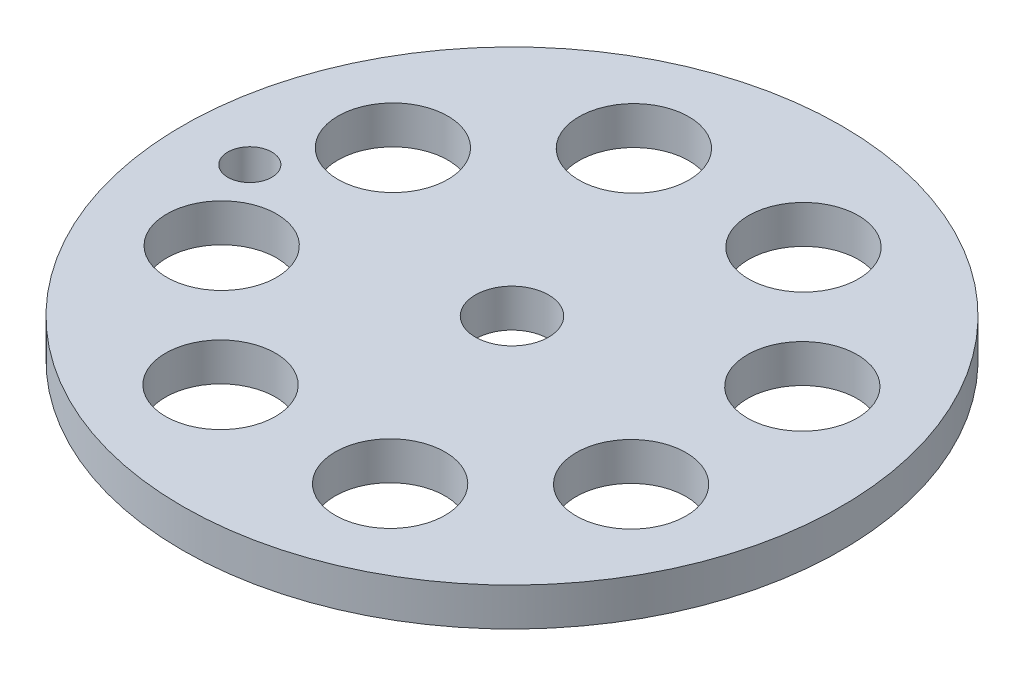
from build123d import *

# Parameters (mm, degrees)
SKETCH1_R          = 28.575
SKETCH1_R_2        = 3.175
EXTRUDE1_DEPTH     = 1.651
SKETCH2_R          = 4.7625
CUT_EXTRUDE1_DEPTH = 41.545831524
CIRPATTERN1_COUNT  = 8
SKETCH3_R          = 1.905
CUT_EXTRUDE2_DEPTH = 41.545831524


with BuildPart() as part:
    # Sketch1 → Extrude1 (new, symmetric)
    with BuildSketch(Plane(origin=(0, 0, 0), x_dir=(1, 0, 0), z_dir=(0, 1, 0))):
        with Locations(Location((0, 0, 0), (0, 0, 90))):
            Circle(SKETCH1_R)
        with Locations(Location((0, 0, 0), (0, 0, 90))):
            Circle(SKETCH1_R_2, mode=Mode.SUBTRACT)
    extrude(amount=EXTRUDE1_DEPTH, both=True)

    # Sketch2 → Cut-Extrude1 (cut, through all)
    with BuildSketch(Plane(origin=(0, 1.651, 0), x_dir=(-1, 0, 0), z_dir=(0, 1, 0))):
        with Locations(Location((-17.869468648, -7.3025, 0), (0, 0, 90))):
            Circle(SKETCH2_R)
    cut_extrude1 = extrude(amount=-CUT_EXTRUDE1_DEPTH, mode=Mode.SUBTRACT)

    # CirPattern1: Cut-Extrude1 ×8 about axis
    cirpattern1_axis = Axis((0, 0, 0), (0, 1, 0))
    for i in range(1, CIRPATTERN1_COUNT):
        add(cut_extrude1.rotate(cirpattern1_axis, i * 360 / CIRPATTERN1_COUNT), mode=Mode.SUBTRACT)

    # Sketch3 → Cut-Extrude2 (cut, through all)
    with BuildSketch(Plane(origin=(0, 1.651, 0), x_dir=(-1, 0, 0), z_dir=(0, 1, 0))):
        with Locations(Location((22.733, 0, 0), (0, 0, 90))):
            Circle(SKETCH3_R)
    extrude(amount=-CUT_EXTRUDE2_DEPTH, mode=Mode.SUBTRACT)


solid = part.part
